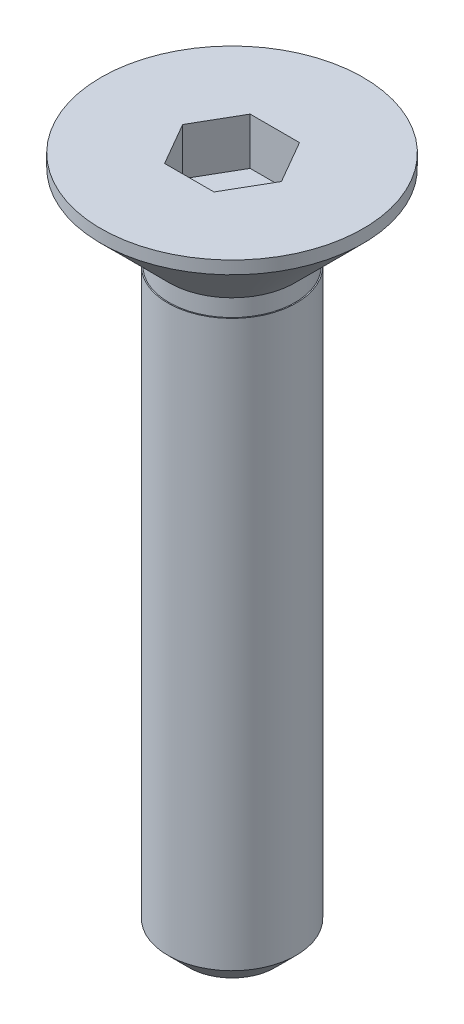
ISO-10303-21;
HEADER;
FILE_DESCRIPTION(('STEP AP214'),'2;1');
FILE_NAME('part.step','',(''),(''),'','','');
FILE_SCHEMA(('AUTOMOTIVE_DESIGN { 1 0 10303 214 1 1 1 1 }'));
ENDSEC;
DATA;
#1=APPLICATION_CONTEXT('core data for automotive mechanical design processes');
#2=APPLICATION_PROTOCOL_DEFINITION('international standard','automotive_design',2000,#1);
#3=PRODUCT_CONTEXT('',#1,'mechanical');
#4=PRODUCT('Part','Part','',(#3));
#5=PRODUCT_RELATED_PRODUCT_CATEGORY('part','',(#4));
#6=PRODUCT_DEFINITION_FORMATION('','',#4);
#7=PRODUCT_DEFINITION_CONTEXT('part definition',#1,'design');
#8=PRODUCT_DEFINITION('design','',#6,#7);
#9=PRODUCT_DEFINITION_SHAPE('','',#8);
#10=(LENGTH_UNIT() NAMED_UNIT(*) SI_UNIT(.MILLI.,.METRE.));
#11=(NAMED_UNIT(*) PLANE_ANGLE_UNIT() SI_UNIT($,.RADIAN.));
#12=(NAMED_UNIT(*) SI_UNIT($,.STERADIAN.) SOLID_ANGLE_UNIT());
#13=UNCERTAINTY_MEASURE_WITH_UNIT(LENGTH_MEASURE(1.E-05),#10,'distance_accuracy_value','');
#14=(GEOMETRIC_REPRESENTATION_CONTEXT(3) GLOBAL_UNCERTAINTY_ASSIGNED_CONTEXT((#13)) GLOBAL_UNIT_ASSIGNED_CONTEXT((#10,
#11,#12)) REPRESENTATION_CONTEXT('',''));
#15=CARTESIAN_POINT('',(0.,0.,0.));
#16=DIRECTION('',(0.,0.,1.));
#17=DIRECTION('',(1.,0.,0.));
#18=AXIS2_PLACEMENT_3D('',#15,#16,#17);
#19=CARTESIAN_POINT('',(3.06500000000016,2.28999999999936,-1.22124532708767E-12));
#20=DIRECTION('',(0.,-1.00000000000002,0.));
#21=DIRECTION('',(1.00000000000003,0.,0.));
#22=AXIS2_PLACEMENT_3D('',#19,#20,#21);
#23=PLANE('',#22);
#24=DIRECTION('',(0.500000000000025,0.,-0.866025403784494));
#25=VECTOR('',#24,1.);
#26=CARTESIAN_POINT('',(0.577350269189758,2.28999999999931,0.999999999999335));
#27=LINE('',#26,#25);
#28=CARTESIAN_POINT('',(0.577350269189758,2.28999999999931,0.999999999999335));
#29=VERTEX_POINT('',#28);
#30=CARTESIAN_POINT('',(1.15470053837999,2.28999999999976,-1.99840144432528E-12));
#31=VERTEX_POINT('',#30);
#32=EDGE_CURVE('E140',#29,#31,#27,.T.);
#33=ORIENTED_EDGE('',*,*,#32,.F.);
#34=DIRECTION('',(1.00000000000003,0.,0.));
#35=VECTOR('',#34,1.);
#36=CARTESIAN_POINT('',(-0.577350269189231,2.28999999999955,0.999999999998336));
#37=LINE('',#36,#35);
#38=CARTESIAN_POINT('',(-0.577350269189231,2.28999999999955,0.999999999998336));
#39=VERTEX_POINT('',#38);
#40=EDGE_CURVE('E57',#39,#29,#37,.T.);
#41=ORIENTED_EDGE('',*,*,#40,.F.);
#42=DIRECTION('',(0.500000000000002,0.,0.866025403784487));
#43=VECTOR('',#42,1.);
#44=CARTESIAN_POINT('',(-1.15470053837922,2.28999999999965,-1.11022302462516E-12));
#45=LINE('',#44,#43);
#46=CARTESIAN_POINT('',(-1.15470053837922,2.28999999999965,-1.11022302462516E-12));
#47=VERTEX_POINT('',#46);
#48=EDGE_CURVE('E152',#47,#39,#45,.T.);
#49=ORIENTED_EDGE('',*,*,#48,.F.);
#50=DIRECTION('',(-0.500000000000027,0.,0.866025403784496));
#51=VECTOR('',#50,1.);
#52=CARTESIAN_POINT('',(-0.577350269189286,2.28999999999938,-1.00000000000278));
#53=LINE('',#52,#51);
#54=CARTESIAN_POINT('',(-0.577350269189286,2.28999999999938,-1.00000000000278));
#55=VERTEX_POINT('',#54);
#56=EDGE_CURVE('E149',#55,#47,#53,.T.);
#57=ORIENTED_EDGE('',*,*,#56,.F.);
#58=DIRECTION('',(-1.00000000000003,0.,0.));
#59=VECTOR('',#58,1.);
#60=CARTESIAN_POINT('',(0.577350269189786,2.28999999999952,-1.00000000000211));
#61=LINE('',#60,#59);
#62=CARTESIAN_POINT('',(0.577350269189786,2.28999999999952,-1.00000000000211));
#63=VERTEX_POINT('',#62);
#64=EDGE_CURVE('E105',#63,#55,#61,.T.);
#65=ORIENTED_EDGE('',*,*,#64,.F.);
#66=DIRECTION('',(-0.5,0.,-0.866025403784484));
#67=VECTOR('',#66,1.);
#68=CARTESIAN_POINT('',(1.15470053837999,2.28999999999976,-1.99840144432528E-12));
#69=LINE('',#68,#67);
#70=EDGE_CURVE('E144',#31,#63,#69,.T.);
#71=ORIENTED_EDGE('',*,*,#70,.F.);
#72=EDGE_LOOP('',(#33,#41,#49,#57,#65,#71));
#73=FACE_BOUND('',#72,.T.);
#74=CARTESIAN_POINT('',(3.33066907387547E-13,2.28999999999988,-2.1094237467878E-12));
#75=DIRECTION('',(0.,1.00000000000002,0.));
#76=DIRECTION('',(-1.00000000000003,0.,0.));
#77=AXIS2_PLACEMENT_3D('',#74,#75,#76);
#78=CIRCLE('',#77,3.065);
#79=CARTESIAN_POINT('',(-3.06499999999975,2.28999999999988,-2.08203093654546E-12));
#80=VERTEX_POINT('',#79);
#81=EDGE_CURVE('E158',#80,#80,#78,.T.);
#82=ORIENTED_EDGE('',*,*,#81,.T.);
#83=EDGE_LOOP('',(#82));
#84=FACE_BOUND('',#83,.T.);
#85=ADVANCED_FACE('F42',(#73,#84),#23,.F.);
#86=CARTESIAN_POINT('',(1.2490009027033E-13,-13.710000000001,-1.55431223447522E-12));
#87=DIRECTION('',(0.,1.00000000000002,0.));
#88=DIRECTION('',(-1.00000000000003,0.,0.));
#89=AXIS2_PLACEMENT_3D('',#86,#87,#88);
#90=PLANE('',#89);
#91=CARTESIAN_POINT('',(1.2490009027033E-13,-13.710000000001,-1.55431223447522E-12));
#92=DIRECTION('',(0.,1.00000000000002,0.));
#93=DIRECTION('',(-1.00000000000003,0.,0.));
#94=AXIS2_PLACEMENT_3D('',#91,#92,#93);
#95=CIRCLE('',#94,1.);
#96=CARTESIAN_POINT('',(-0.999999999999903,-13.710000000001,-1.54537493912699E-12));
#97=VERTEX_POINT('',#96);
#98=EDGE_CURVE('E11',#97,#97,#95,.T.);
#99=ORIENTED_EDGE('',*,*,#98,.F.);
#100=EDGE_LOOP('',(#99));
#101=FACE_BOUND('',#100,.T.);
#102=ADVANCED_FACE('F195',(#101),#90,.F.);
#103=CARTESIAN_POINT('',(1.2490009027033E-13,-13.710000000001,-1.55431223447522E-12));
#104=DIRECTION('',(0.,1.00000000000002,0.));
#105=DIRECTION('',(-1.00000000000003,0.,0.));
#106=AXIS2_PLACEMENT_3D('',#103,#104,#105);
#107=CONICAL_SURFACE('',#106,1.,0.785398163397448);
#108=CARTESIAN_POINT('',(2.77555756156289E-13,-13.2100000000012,-1.66533453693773E-12));
#109=DIRECTION('',(0.,1.00000000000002,0.));
#110=DIRECTION('',(-1.00000000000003,0.,0.));
#111=AXIS2_PLACEMENT_3D('',#108,#109,#110);
#112=CIRCLE('',#111,1.5);
#113=CARTESIAN_POINT('',(-1.49999999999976,-13.2100000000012,-1.65192859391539E-12));
#114=VERTEX_POINT('',#113);
#115=EDGE_CURVE('E50',#114,#114,#112,.T.);
#116=ORIENTED_EDGE('',*,*,#115,.F.);
#117=EDGE_LOOP('',(#116));
#118=FACE_BOUND('',#117,.T.);
#119=ORIENTED_EDGE('',*,*,#98,.T.);
#120=EDGE_LOOP('',(#119));
#121=FACE_BOUND('',#120,.T.);
#122=ADVANCED_FACE('F192',(#118,#121),#107,.T.);
#123=CARTESIAN_POINT('',(3.33066907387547E-13,2.28999999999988,-2.1094237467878E-12));
#124=DIRECTION('',(0.,1.00000000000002,0.));
#125=DIRECTION('',(-1.00000000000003,0.,0.));
#126=AXIS2_PLACEMENT_3D('',#123,#124,#125);
#127=CYLINDRICAL_SURFACE('',#126,1.5);
#128=CARTESIAN_POINT('',(0.,0.,0.));
#129=DIRECTION('',(0.,1.00000000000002,0.));
#130=DIRECTION('',(-1.00000000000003,0.,0.));
#131=AXIS2_PLACEMENT_3D('',#128,#129,#130);
#132=CIRCLE('',#131,1.5);
#133=CARTESIAN_POINT('',(-1.50000000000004,0.,0.));
#134=VERTEX_POINT('',#133);
#135=EDGE_CURVE('E182',#134,#134,#132,.T.);
#136=ORIENTED_EDGE('',*,*,#135,.F.);
#137=EDGE_LOOP('',(#136));
#138=FACE_BOUND('',#137,.T.);
#139=ORIENTED_EDGE('',*,*,#115,.T.);
#140=EDGE_LOOP('',(#139));
#141=FACE_BOUND('',#140,.T.);
#142=ADVANCED_FACE('F190',(#138,#141),#127,.T.);
#143=CARTESIAN_POINT('',(1.50000000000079,0.,-2.66453525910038E-12));
#144=DIRECTION('',(0.,-1.00000000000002,0.));
#145=DIRECTION('',(1.00000000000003,0.,0.));
#146=AXIS2_PLACEMENT_3D('',#143,#144,#145);
#147=PLANE('',#146);
#148=CARTESIAN_POINT('',(0.,0.,0.));
#149=DIRECTION('',(0.,1.00000000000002,0.));
#150=DIRECTION('',(-1.00000000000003,0.,0.));
#151=AXIS2_PLACEMENT_3D('',#148,#149,#150);
#152=CIRCLE('',#151,1.475);
#153=CARTESIAN_POINT('',(-1.47500000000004,0.,0.));
#154=VERTEX_POINT('',#153);
#155=EDGE_CURVE('E178',#154,#154,#152,.T.);
#156=ORIENTED_EDGE('',*,*,#155,.F.);
#157=EDGE_LOOP('',(#156));
#158=FACE_BOUND('',#157,.T.);
#159=ORIENTED_EDGE('',*,*,#135,.T.);
#160=EDGE_LOOP('',(#159));
#161=FACE_BOUND('',#160,.T.);
#162=ADVANCED_FACE('F207',(#158,#161),#147,.F.);
#163=CARTESIAN_POINT('',(3.33066907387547E-13,2.28999999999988,-2.1094237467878E-12));
#164=DIRECTION('',(0.,1.00000000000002,0.));
#165=DIRECTION('',(-1.00000000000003,0.,0.));
#166=AXIS2_PLACEMENT_3D('',#163,#164,#165);
#167=CYLINDRICAL_SURFACE('',#166,1.475);
#168=CARTESIAN_POINT('',(0.,0.399999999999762,-2.44249065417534E-12));
#169=DIRECTION('',(0.,1.00000000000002,0.));
#170=DIRECTION('',(-1.00000000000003,0.,0.));
#171=AXIS2_PLACEMENT_3D('',#168,#169,#170);
#172=CIRCLE('',#171,1.475);
#173=CARTESIAN_POINT('',(-1.4750000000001,0.399999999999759,-2.4293081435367E-12));
#174=VERTEX_POINT('',#173);
#175=EDGE_CURVE('E174',#174,#174,#172,.T.);
#176=ORIENTED_EDGE('',*,*,#175,.F.);
#177=EDGE_LOOP('',(#176));
#178=FACE_BOUND('',#177,.T.);
#179=ORIENTED_EDGE('',*,*,#155,.T.);
#180=EDGE_LOOP('',(#179));
#181=FACE_BOUND('',#180,.T.);
#182=ADVANCED_FACE('F211',(#178,#181),#167,.T.);
#183=CARTESIAN_POINT('',(0.,0.399999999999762,-2.44249065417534E-12));
#184=DIRECTION('',(0.,1.00000000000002,0.));
#185=DIRECTION('',(-1.00000000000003,0.,0.));
#186=AXIS2_PLACEMENT_3D('',#183,#184,#185);
#187=CONICAL_SURFACE('',#186,1.475,0.78539816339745);
#188=CARTESIAN_POINT('',(0.,1.98999999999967,-1.88737914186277E-12));
#189=DIRECTION('',(0.,1.00000000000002,0.));
#190=DIRECTION('',(-1.00000000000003,0.,0.));
#191=AXIS2_PLACEMENT_3D('',#188,#189,#190);
#192=CIRCLE('',#191,3.065);
#193=CARTESIAN_POINT('',(-3.065,1.98999999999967,-1.85998633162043E-12));
#194=VERTEX_POINT('',#193);
#195=EDGE_CURVE('E170',#194,#194,#192,.T.);
#196=ORIENTED_EDGE('',*,*,#195,.F.);
#197=EDGE_LOOP('',(#196));
#198=FACE_BOUND('',#197,.T.);
#199=ORIENTED_EDGE('',*,*,#175,.T.);
#200=EDGE_LOOP('',(#199));
#201=FACE_BOUND('',#200,.T.);
#202=ADVANCED_FACE('F215',(#198,#201),#187,.T.);
#203=CARTESIAN_POINT('',(3.33066907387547E-13,2.28999999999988,-2.1094237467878E-12));
#204=DIRECTION('',(0.,1.00000000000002,0.));
#205=DIRECTION('',(-1.00000000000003,0.,0.));
#206=AXIS2_PLACEMENT_3D('',#203,#204,#205);
#207=CYLINDRICAL_SURFACE('',#206,3.065);
#208=ORIENTED_EDGE('',*,*,#81,.F.);
#209=EDGE_LOOP('',(#208));
#210=FACE_BOUND('',#209,.T.);
#211=ORIENTED_EDGE('',*,*,#195,.T.);
#212=EDGE_LOOP('',(#211));
#213=FACE_BOUND('',#212,.T.);
#214=ADVANCED_FACE('F219',(#210,#213),#207,.T.);
#215=CARTESIAN_POINT('',(-0.577350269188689,1.18999999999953,0.999999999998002));
#216=DIRECTION('',(0.,0.,1.00000000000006));
#217=DIRECTION('',(1.00000000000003,0.,0.));
#218=AXIS2_PLACEMENT_3D('',#215,#216,#217);
#219=PLANE('',#218);
#220=ORIENTED_EDGE('',*,*,#40,.T.);
#221=DIRECTION('',(0.,1.00000000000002,0.));
#222=VECTOR('',#221,1.);
#223=CARTESIAN_POINT('',(0.577350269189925,1.189999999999,0.999999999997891));
#224=LINE('',#223,#222);
#225=CARTESIAN_POINT('',(0.577350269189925,1.189999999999,0.999999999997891));
#226=VERTEX_POINT('',#225);
#227=EDGE_CURVE('E87',#226,#29,#224,.T.);
#228=ORIENTED_EDGE('',*,*,#227,.F.);
#229=DIRECTION('',(1.00000000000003,0.,0.));
#230=VECTOR('',#229,1.);
#231=CARTESIAN_POINT('',(-0.577350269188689,1.18999999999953,0.999999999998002));
#232=LINE('',#231,#230);
#233=CARTESIAN_POINT('',(-0.577350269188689,1.18999999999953,0.999999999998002));
#234=VERTEX_POINT('',#233);
#235=EDGE_CURVE('E155',#234,#226,#232,.T.);
#236=ORIENTED_EDGE('',*,*,#235,.F.);
#237=DIRECTION('',(0.,1.00000000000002,0.));
#238=VECTOR('',#237,1.);
#239=CARTESIAN_POINT('',(-0.577350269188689,1.18999999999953,0.999999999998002));
#240=LINE('',#239,#238);
#241=EDGE_CURVE('E65',#234,#39,#240,.T.);
#242=ORIENTED_EDGE('',*,*,#241,.T.);
#243=EDGE_LOOP('',(#220,#228,#236,#242));
#244=FACE_BOUND('',#243,.T.);
#245=ADVANCED_FACE('F223',(#244),#219,.F.);
#246=CARTESIAN_POINT('',(-1.15470053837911,1.18999999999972,-3.21964677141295E-12));
#247=DIRECTION('',(-0.866025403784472,0.,0.500000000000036));
#248=DIRECTION('',(0.500000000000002,0.,0.866025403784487));
#249=AXIS2_PLACEMENT_3D('',#246,#247,#248);
#250=PLANE('',#249);
#251=ORIENTED_EDGE('',*,*,#48,.T.);
#252=ORIENTED_EDGE('',*,*,#241,.F.);
#253=DIRECTION('',(0.500000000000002,0.,0.866025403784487));
#254=VECTOR('',#253,1.);
#255=CARTESIAN_POINT('',(-1.15470053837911,1.18999999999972,-3.21964677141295E-12));
#256=LINE('',#255,#254);
#257=CARTESIAN_POINT('',(-1.15470053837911,1.18999999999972,-3.21964677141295E-12));
#258=VERTEX_POINT('',#257);
#259=EDGE_CURVE('E119',#258,#234,#256,.T.);
#260=ORIENTED_EDGE('',*,*,#259,.F.);
#261=DIRECTION('',(0.,1.00000000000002,0.));
#262=VECTOR('',#261,1.);
#263=CARTESIAN_POINT('',(-1.15470053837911,1.18999999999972,-3.21964677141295E-12));
#264=LINE('',#263,#262);
#265=EDGE_CURVE('E110',#258,#47,#264,.T.);
#266=ORIENTED_EDGE('',*,*,#265,.T.);
#267=EDGE_LOOP('',(#251,#252,#260,#266));
#268=FACE_BOUND('',#267,.T.);
#269=ADVANCED_FACE('F227',(#268),#250,.F.);
#270=CARTESIAN_POINT('',(-0.577350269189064,1.18999999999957,-1.00000000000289));
#271=DIRECTION('',(-0.86602540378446,0.,-0.500000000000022));
#272=DIRECTION('',(-0.500000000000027,0.,0.866025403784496));
#273=AXIS2_PLACEMENT_3D('',#270,#271,#272);
#274=PLANE('',#273);
#275=ORIENTED_EDGE('',*,*,#56,.T.);
#276=ORIENTED_EDGE('',*,*,#265,.F.);
#277=DIRECTION('',(-0.500000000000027,0.,0.866025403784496));
#278=VECTOR('',#277,1.);
#279=CARTESIAN_POINT('',(-0.577350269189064,1.18999999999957,-1.00000000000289));
#280=LINE('',#279,#278);
#281=CARTESIAN_POINT('',(-0.577350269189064,1.18999999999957,-1.00000000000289));
#282=VERTEX_POINT('',#281);
#283=EDGE_CURVE('E114',#282,#258,#280,.T.);
#284=ORIENTED_EDGE('',*,*,#283,.F.);
#285=DIRECTION('',(0.,1.00000000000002,0.));
#286=VECTOR('',#285,1.);
#287=CARTESIAN_POINT('',(-0.577350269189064,1.18999999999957,-1.00000000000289));
#288=LINE('',#287,#286);
#289=EDGE_CURVE('E98',#282,#55,#288,.T.);
#290=ORIENTED_EDGE('',*,*,#289,.T.);
#291=EDGE_LOOP('',(#275,#276,#284,#290));
#292=FACE_BOUND('',#291,.T.);
#293=ADVANCED_FACE('F115',(#292),#274,.F.);
#294=CARTESIAN_POINT('',(0.5773502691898,1.18999999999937,-1.00000000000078));
#295=DIRECTION('',(0.,0.,-1.00000000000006));
#296=DIRECTION('',(-1.00000000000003,0.,0.));
#297=AXIS2_PLACEMENT_3D('',#294,#295,#296);
#298=PLANE('',#297);
#299=ORIENTED_EDGE('',*,*,#64,.T.);
#300=ORIENTED_EDGE('',*,*,#289,.F.);
#301=DIRECTION('',(-1.00000000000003,0.,0.));
#302=VECTOR('',#301,1.);
#303=CARTESIAN_POINT('',(0.5773502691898,1.18999999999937,-1.00000000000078));
#304=LINE('',#303,#302);
#305=CARTESIAN_POINT('',(0.5773502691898,1.18999999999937,-1.00000000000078));
#306=VERTEX_POINT('',#305);
#307=EDGE_CURVE('E102',#306,#282,#304,.T.);
#308=ORIENTED_EDGE('',*,*,#307,.F.);
#309=DIRECTION('',(0.,1.00000000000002,0.));
#310=VECTOR('',#309,1.);
#311=CARTESIAN_POINT('',(0.5773502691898,1.18999999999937,-1.00000000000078));
#312=LINE('',#311,#310);
#313=EDGE_CURVE('E111',#306,#63,#312,.T.);
#314=ORIENTED_EDGE('',*,*,#313,.T.);
#315=EDGE_LOOP('',(#299,#300,#308,#314));
#316=FACE_BOUND('',#315,.T.);
#317=ADVANCED_FACE('F100',(#316),#298,.F.);
#318=CARTESIAN_POINT('',(1.15470053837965,1.18999999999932,-2.44249065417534E-12));
#319=DIRECTION('',(0.866025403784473,0.,-0.500000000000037));
#320=DIRECTION('',(-0.5,0.,-0.866025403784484));
#321=AXIS2_PLACEMENT_3D('',#318,#319,#320);
#322=PLANE('',#321);
#323=ORIENTED_EDGE('',*,*,#70,.T.);
#324=ORIENTED_EDGE('',*,*,#313,.F.);
#325=DIRECTION('',(-0.5,0.,-0.866025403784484));
#326=VECTOR('',#325,1.);
#327=CARTESIAN_POINT('',(1.15470053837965,1.18999999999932,-2.44249065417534E-12));
#328=LINE('',#327,#326);
#329=CARTESIAN_POINT('',(1.15470053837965,1.18999999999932,-2.44249065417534E-12));
#330=VERTEX_POINT('',#329);
#331=EDGE_CURVE('E125',#330,#306,#328,.T.);
#332=ORIENTED_EDGE('',*,*,#331,.F.);
#333=DIRECTION('',(0.,1.00000000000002,0.));
#334=VECTOR('',#333,1.);
#335=CARTESIAN_POINT('',(1.15470053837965,1.18999999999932,-2.44249065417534E-12));
#336=LINE('',#335,#334);
#337=EDGE_CURVE('E162',#330,#31,#336,.T.);
#338=ORIENTED_EDGE('',*,*,#337,.T.);
#339=EDGE_LOOP('',(#323,#324,#332,#338));
#340=FACE_BOUND('',#339,.T.);
#341=ADVANCED_FACE('F231',(#340),#322,.F.);
#342=CARTESIAN_POINT('',(0.577350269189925,1.189999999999,0.999999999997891));
#343=DIRECTION('',(0.86602540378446,0.,0.500000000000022));
#344=DIRECTION('',(0.500000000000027,0.,-0.866025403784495));
#345=AXIS2_PLACEMENT_3D('',#342,#343,#344);
#346=PLANE('',#345);
#347=ORIENTED_EDGE('',*,*,#32,.T.);
#348=ORIENTED_EDGE('',*,*,#337,.F.);
#349=DIRECTION('',(0.500000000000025,0.,-0.866025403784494));
#350=VECTOR('',#349,1.);
#351=CARTESIAN_POINT('',(0.577350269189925,1.189999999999,0.999999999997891));
#352=LINE('',#351,#350);
#353=EDGE_CURVE('E132',#226,#330,#352,.T.);
#354=ORIENTED_EDGE('',*,*,#353,.F.);
#355=ORIENTED_EDGE('',*,*,#227,.T.);
#356=EDGE_LOOP('',(#347,#348,#354,#355));
#357=FACE_BOUND('',#356,.T.);
#358=ADVANCED_FACE('F228',(#357),#346,.F.);
#359=CARTESIAN_POINT('',(4.9960036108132E-13,1.18999999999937,-7.7715611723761E-13));
#360=DIRECTION('',(0.,1.00000000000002,0.));
#361=DIRECTION('',(0.,0.,1.00000000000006));
#362=AXIS2_PLACEMENT_3D('',#359,#360,#361);
#363=PLANE('',#362);
#364=ORIENTED_EDGE('',*,*,#235,.T.);
#365=ORIENTED_EDGE('',*,*,#353,.T.);
#366=ORIENTED_EDGE('',*,*,#331,.T.);
#367=ORIENTED_EDGE('',*,*,#307,.T.);
#368=ORIENTED_EDGE('',*,*,#283,.T.);
#369=ORIENTED_EDGE('',*,*,#259,.T.);
#370=EDGE_LOOP('',(#364,#365,#366,#367,#368,#369));
#371=FACE_BOUND('',#370,.T.);
#372=ADVANCED_FACE('F122',(#371),#363,.T.);
#373=CLOSED_SHELL('',(#85,#102,#122,#142,#162,#182,#202,#214,#245,#269,#293,#317,#341,#358,#372));
#374=MANIFOLD_SOLID_BREP('B2',#373);
#375=ADVANCED_BREP_SHAPE_REPRESENTATION('',(#18,#374),#14);
#376=SHAPE_DEFINITION_REPRESENTATION(#9,#375);
ENDSEC;
END-ISO-10303-21;
